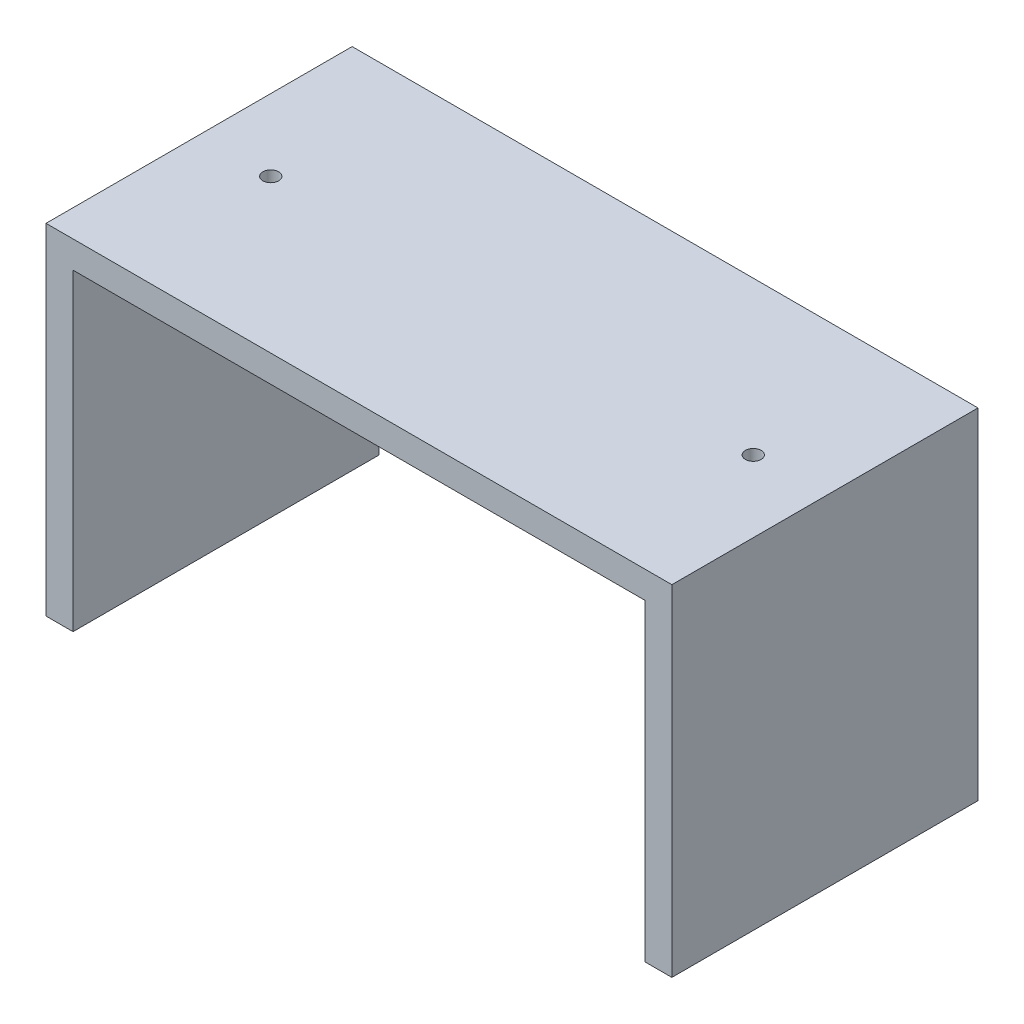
from build123d import *

# Parameters (mm, degrees)
BOSS_EXTRUDE1_DEPTH = 18
SKETCH2_R           = 0.46355
CUT_EXTRUDE1_DEPTH  = 10


with BuildPart() as part:
    # Sketch1 → Boss-Extrude1 (new body)
    with BuildSketch(Plane.XY):
        Polygon((1.59, -20), (1.59, -1.59), (35.21, -1.59), (35.21, -20), (36.8, -20), (36.8, 0), (0, 0), (0, -20), align=None)
    extrude(amount=BOSS_EXTRUDE1_DEPTH)

    # Sketch2 → Cut-Extrude1 (cut)
    with BuildSketch(Plane(origin=(0, 0, 0), x_dir=(1, 0, 0), z_dir=(0, 1, 0))):
        with Locations(Location((4.2141, -9, 0), (0, 0, 270))):
            Circle(SKETCH2_R)
        with Locations(Location((32.5859, -9, 0), (0, 0, 270))):
            Circle(SKETCH2_R)
    extrude(amount=-CUT_EXTRUDE1_DEPTH, mode=Mode.SUBTRACT)


solid = part.part
